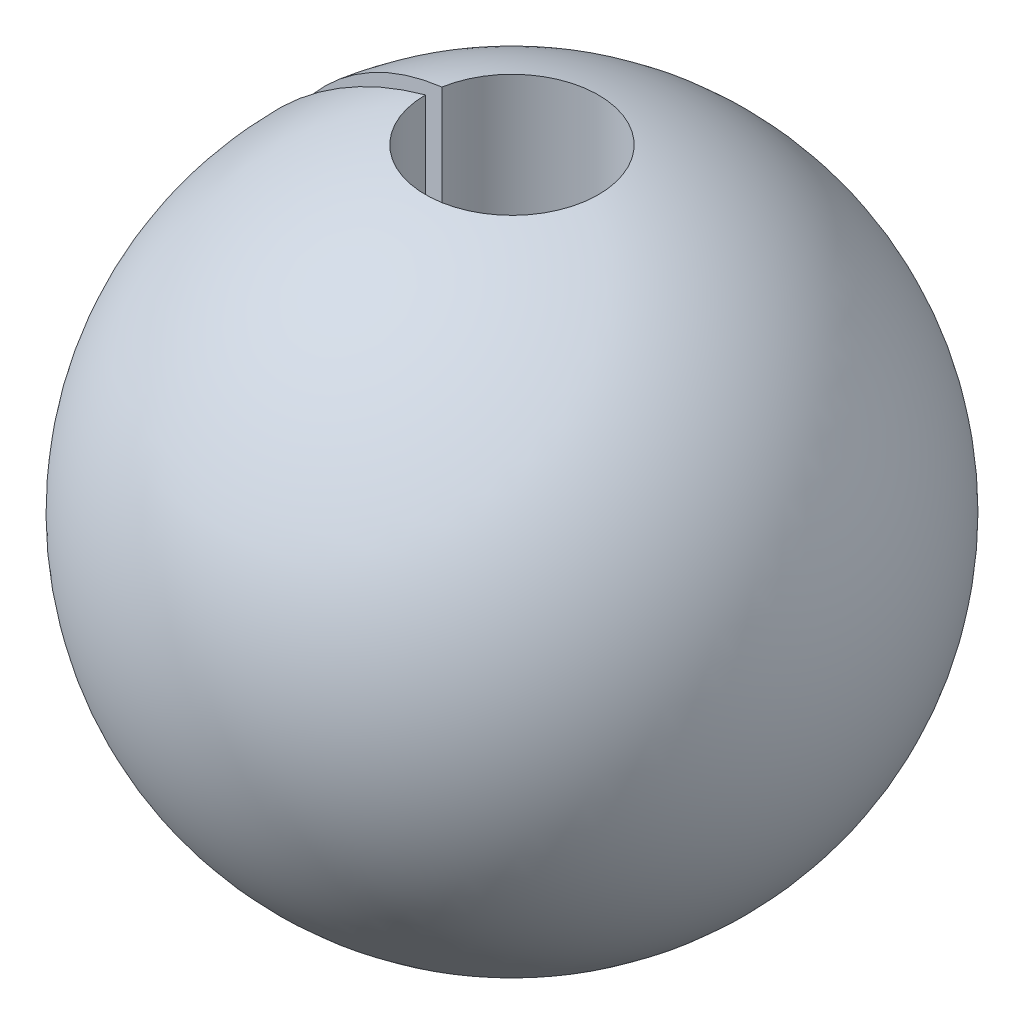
from build123d import *

# Parameters (mm, degrees)
REVOLVE_1_ANGLE = 350


with BuildPart() as part:
    # Sketch 2 → Revolve 1 (revolve)
    with BuildSketch(Plane.XY):
        with BuildLine():
            Line((-368, 1353.877764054), (-368, -1353.877764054))
            ThreePointArc((-368, -1353.877764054), (-1403, 0), (-368, 1353.877764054))
        make_face()
    revolve(axis=Axis((0, -1000, 0), (0, 1, 0)), revolution_arc=REVOLVE_1_ANGLE)


solid = part.part
